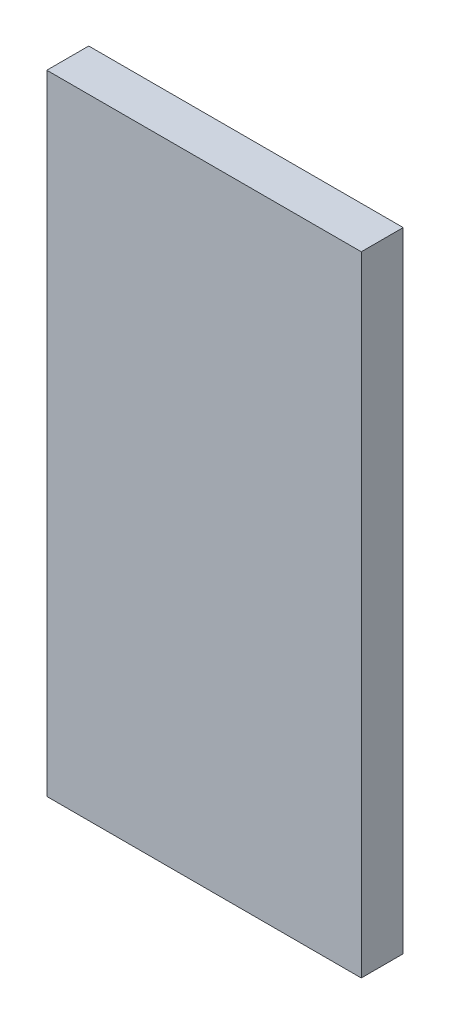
ISO-10303-21;
HEADER;
FILE_DESCRIPTION(('STEP AP214'),'2;1');
FILE_NAME('part.step','',(''),(''),'','','');
FILE_SCHEMA(('AUTOMOTIVE_DESIGN { 1 0 10303 214 1 1 1 1 }'));
ENDSEC;
DATA;
#1=APPLICATION_CONTEXT('core data for automotive mechanical design processes');
#2=APPLICATION_PROTOCOL_DEFINITION('international standard','automotive_design',2000,#1);
#3=PRODUCT_CONTEXT('',#1,'mechanical');
#4=PRODUCT('Part','Part','',(#3));
#5=PRODUCT_RELATED_PRODUCT_CATEGORY('part','',(#4));
#6=PRODUCT_DEFINITION_FORMATION('','',#4);
#7=PRODUCT_DEFINITION_CONTEXT('part definition',#1,'design');
#8=PRODUCT_DEFINITION('design','',#6,#7);
#9=PRODUCT_DEFINITION_SHAPE('','',#8);
#10=(LENGTH_UNIT() NAMED_UNIT(*) SI_UNIT(.MILLI.,.METRE.));
#11=(NAMED_UNIT(*) PLANE_ANGLE_UNIT() SI_UNIT($,.RADIAN.));
#12=(NAMED_UNIT(*) SI_UNIT($,.STERADIAN.) SOLID_ANGLE_UNIT());
#13=UNCERTAINTY_MEASURE_WITH_UNIT(LENGTH_MEASURE(1.E-05),#10,'distance_accuracy_value','');
#14=(GEOMETRIC_REPRESENTATION_CONTEXT(3) GLOBAL_UNCERTAINTY_ASSIGNED_CONTEXT((#13)) GLOBAL_UNIT_ASSIGNED_CONTEXT((#10,
#11,#12)) REPRESENTATION_CONTEXT('',''));
#15=CARTESIAN_POINT('',(0.,0.,0.));
#16=DIRECTION('',(0.,0.,1.));
#17=DIRECTION('',(1.,0.,0.));
#18=AXIS2_PLACEMENT_3D('',#15,#16,#17);
#19=CARTESIAN_POINT('',(6.0000007,-11.99999886,1.6));
#20=DIRECTION('',(0.,0.,-1.));
#21=DIRECTION('',(-1.,0.,0.));
#22=AXIS2_PLACEMENT_3D('',#19,#20,#21);
#23=PLANE('',#22);
#24=DIRECTION('',(1.,0.,0.));
#25=VECTOR('',#24,1.);
#26=CARTESIAN_POINT('',(6.0000007,12.0000014,1.6));
#27=LINE('',#26,#25);
#28=CARTESIAN_POINT('',(6.0000007,12.0000014,1.6));
#29=VERTEX_POINT('',#28);
#30=CARTESIAN_POINT('',(-5.99999816,12.0000014,1.6));
#31=VERTEX_POINT('',#30);
#32=EDGE_CURVE('E55',#29,#31,#27,.F.);
#33=ORIENTED_EDGE('',*,*,#32,.T.);
#34=DIRECTION('',(0.,1.,0.));
#35=VECTOR('',#34,1.);
#36=CARTESIAN_POINT('',(-5.99999816,12.0000014,1.6));
#37=LINE('',#36,#35);
#38=CARTESIAN_POINT('',(-5.99999816,-11.99999886,1.6));
#39=VERTEX_POINT('',#38);
#40=EDGE_CURVE('E57',#31,#39,#37,.F.);
#41=ORIENTED_EDGE('',*,*,#40,.T.);
#42=DIRECTION('',(1.,0.,0.));
#43=VECTOR('',#42,1.);
#44=CARTESIAN_POINT('',(-5.99999816,-11.99999886,1.6));
#45=LINE('',#44,#43);
#46=CARTESIAN_POINT('',(6.0000007,-11.99999886,1.6));
#47=VERTEX_POINT('',#46);
#48=EDGE_CURVE('E20',#39,#47,#45,.T.);
#49=ORIENTED_EDGE('',*,*,#48,.T.);
#50=DIRECTION('',(0.,1.,0.));
#51=VECTOR('',#50,1.);
#52=CARTESIAN_POINT('',(6.0000007,-11.99999886,1.6));
#53=LINE('',#52,#51);
#54=EDGE_CURVE('E80',#47,#29,#53,.T.);
#55=ORIENTED_EDGE('',*,*,#54,.T.);
#56=EDGE_LOOP('',(#33,#41,#49,#55));
#57=FACE_BOUND('',#56,.T.);
#58=ADVANCED_FACE('F17',(#57),#23,.F.);
#59=CARTESIAN_POINT('',(-5.99999816,-11.99999886,0.));
#60=DIRECTION('',(0.,1.,0.));
#61=DIRECTION('',(0.,0.,1.));
#62=AXIS2_PLACEMENT_3D('',#59,#60,#61);
#63=PLANE('',#62);
#64=DIRECTION('',(0.,0.,1.));
#65=VECTOR('',#64,1.);
#66=CARTESIAN_POINT('',(6.0000007,-11.99999886,0.));
#67=LINE('',#66,#65);
#68=CARTESIAN_POINT('',(6.0000007,-11.99999886,0.));
#69=VERTEX_POINT('',#68);
#70=EDGE_CURVE('E68',#69,#47,#67,.T.);
#71=ORIENTED_EDGE('',*,*,#70,.T.);
#72=ORIENTED_EDGE('',*,*,#48,.F.);
#73=DIRECTION('',(0.,0.,-1.));
#74=VECTOR('',#73,1.);
#75=CARTESIAN_POINT('',(-5.99999816,-11.99999886,0.));
#76=LINE('',#75,#74);
#77=CARTESIAN_POINT('',(-5.99999816,-11.99999886,0.));
#78=VERTEX_POINT('',#77);
#79=EDGE_CURVE('E63',#39,#78,#76,.T.);
#80=ORIENTED_EDGE('',*,*,#79,.T.);
#81=DIRECTION('',(-1.,0.,0.));
#82=VECTOR('',#81,1.);
#83=CARTESIAN_POINT('',(6.0000007,-11.99999886,0.));
#84=LINE('',#83,#82);
#85=EDGE_CURVE('E83',#69,#78,#84,.T.);
#86=ORIENTED_EDGE('',*,*,#85,.F.);
#87=EDGE_LOOP('',(#71,#72,#80,#86));
#88=FACE_BOUND('',#87,.T.);
#89=ADVANCED_FACE('F65',(#88),#63,.F.);
#90=CARTESIAN_POINT('',(-5.99999816,12.0000014,0.));
#91=DIRECTION('',(1.,0.,0.));
#92=DIRECTION('',(0.,0.,-1.));
#93=AXIS2_PLACEMENT_3D('',#90,#91,#92);
#94=PLANE('',#93);
#95=ORIENTED_EDGE('',*,*,#79,.F.);
#96=ORIENTED_EDGE('',*,*,#40,.F.);
#97=DIRECTION('',(0.,0.,-1.));
#98=VECTOR('',#97,1.);
#99=CARTESIAN_POINT('',(-5.99999816,12.0000014,0.));
#100=LINE('',#99,#98);
#101=CARTESIAN_POINT('',(-5.99999816,12.0000014,0.));
#102=VERTEX_POINT('',#101);
#103=EDGE_CURVE('E75',#31,#102,#100,.T.);
#104=ORIENTED_EDGE('',*,*,#103,.T.);
#105=DIRECTION('',(0.,1.,0.));
#106=VECTOR('',#105,1.);
#107=CARTESIAN_POINT('',(-5.99999816,-11.99999886,0.));
#108=LINE('',#107,#106);
#109=EDGE_CURVE('E72',#78,#102,#108,.T.);
#110=ORIENTED_EDGE('',*,*,#109,.F.);
#111=EDGE_LOOP('',(#95,#96,#104,#110));
#112=FACE_BOUND('',#111,.T.);
#113=ADVANCED_FACE('F70',(#112),#94,.F.);
#114=CARTESIAN_POINT('',(6.0000007,12.0000014,0.));
#115=DIRECTION('',(0.,-1.,0.));
#116=DIRECTION('',(0.,0.,-1.));
#117=AXIS2_PLACEMENT_3D('',#114,#115,#116);
#118=PLANE('',#117);
#119=ORIENTED_EDGE('',*,*,#103,.F.);
#120=ORIENTED_EDGE('',*,*,#32,.F.);
#121=DIRECTION('',(0.,0.,1.));
#122=VECTOR('',#121,1.);
#123=CARTESIAN_POINT('',(6.0000007,12.0000014,0.));
#124=LINE('',#123,#122);
#125=CARTESIAN_POINT('',(6.0000007,12.0000014,0.));
#126=VERTEX_POINT('',#125);
#127=EDGE_CURVE('E35',#29,#126,#124,.F.);
#128=ORIENTED_EDGE('',*,*,#127,.T.);
#129=DIRECTION('',(-1.,0.,0.));
#130=VECTOR('',#129,1.);
#131=CARTESIAN_POINT('',(6.0000007,12.0000014,0.));
#132=LINE('',#131,#130);
#133=EDGE_CURVE('E26',#102,#126,#132,.F.);
#134=ORIENTED_EDGE('',*,*,#133,.F.);
#135=EDGE_LOOP('',(#119,#120,#128,#134));
#136=FACE_BOUND('',#135,.T.);
#137=ADVANCED_FACE('F89',(#136),#118,.F.);
#138=CARTESIAN_POINT('',(6.0000007,-11.99999886,0.));
#139=DIRECTION('',(-1.,0.,0.));
#140=DIRECTION('',(0.,0.,1.));
#141=AXIS2_PLACEMENT_3D('',#138,#139,#140);
#142=PLANE('',#141);
#143=ORIENTED_EDGE('',*,*,#127,.F.);
#144=ORIENTED_EDGE('',*,*,#54,.F.);
#145=ORIENTED_EDGE('',*,*,#70,.F.);
#146=DIRECTION('',(0.,1.,0.));
#147=VECTOR('',#146,1.);
#148=CARTESIAN_POINT('',(6.0000007,-11.99999886,0.));
#149=LINE('',#148,#147);
#150=EDGE_CURVE('E11',#126,#69,#149,.F.);
#151=ORIENTED_EDGE('',*,*,#150,.F.);
#152=EDGE_LOOP('',(#143,#144,#145,#151));
#153=FACE_BOUND('',#152,.T.);
#154=ADVANCED_FACE('F91',(#153),#142,.F.);
#155=CARTESIAN_POINT('',(6.0000007,-11.99999886,0.));
#156=DIRECTION('',(0.,0.,-1.));
#157=DIRECTION('',(-1.,0.,0.));
#158=AXIS2_PLACEMENT_3D('',#155,#156,#157);
#159=PLANE('',#158);
#160=ORIENTED_EDGE('',*,*,#133,.T.);
#161=ORIENTED_EDGE('',*,*,#150,.T.);
#162=ORIENTED_EDGE('',*,*,#85,.T.);
#163=ORIENTED_EDGE('',*,*,#109,.T.);
#164=EDGE_LOOP('',(#160,#161,#162,#163));
#165=FACE_BOUND('',#164,.T.);
#166=ADVANCED_FACE('F88',(#165),#159,.T.);
#167=CLOSED_SHELL('',(#58,#89,#113,#137,#154,#166));
#168=MANIFOLD_SOLID_BREP('B1',#167);
#169=ADVANCED_BREP_SHAPE_REPRESENTATION('',(#18,#168),#14);
#170=SHAPE_DEFINITION_REPRESENTATION(#9,#169);
ENDSEC;
END-ISO-10303-21;
